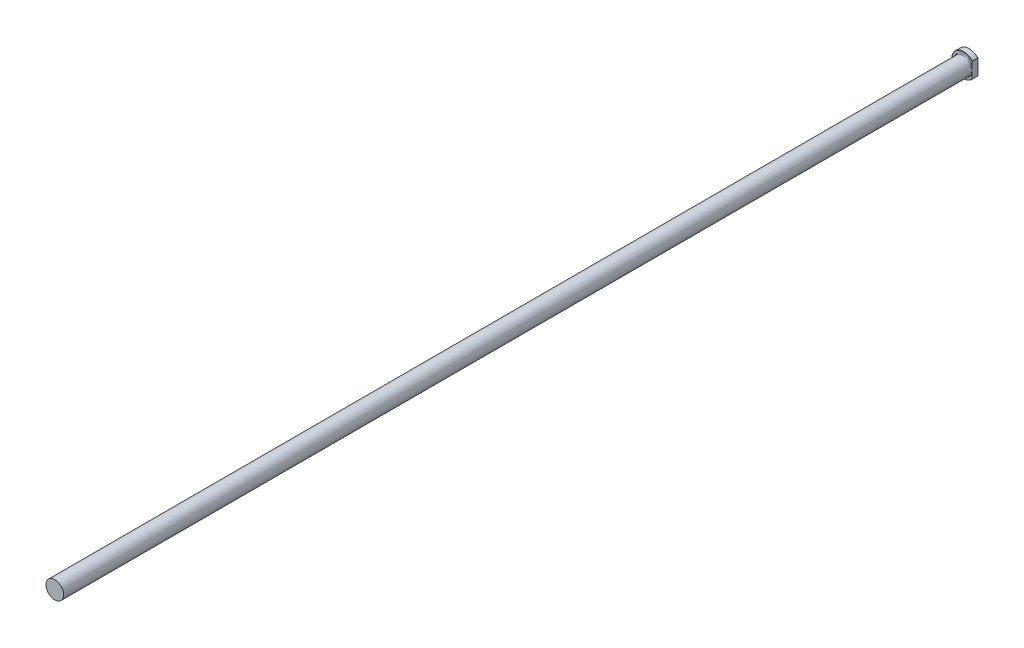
ISO-10303-21;
HEADER;
FILE_DESCRIPTION(('STEP AP214'),'2;1');
FILE_NAME('part.step','',(''),(''),'','','');
FILE_SCHEMA(('AUTOMOTIVE_DESIGN { 1 0 10303 214 1 1 1 1 }'));
ENDSEC;
DATA;
#1=APPLICATION_CONTEXT('core data for automotive mechanical design processes');
#2=APPLICATION_PROTOCOL_DEFINITION('international standard','automotive_design',2000,#1);
#3=PRODUCT_CONTEXT('',#1,'mechanical');
#4=PRODUCT('Part','Part','',(#3));
#5=PRODUCT_RELATED_PRODUCT_CATEGORY('part','',(#4));
#6=PRODUCT_DEFINITION_FORMATION('','',#4);
#7=PRODUCT_DEFINITION_CONTEXT('part definition',#1,'design');
#8=PRODUCT_DEFINITION('design','',#6,#7);
#9=PRODUCT_DEFINITION_SHAPE('','',#8);
#10=(LENGTH_UNIT() NAMED_UNIT(*) SI_UNIT(.MILLI.,.METRE.));
#11=(NAMED_UNIT(*) PLANE_ANGLE_UNIT() SI_UNIT($,.RADIAN.));
#12=(NAMED_UNIT(*) SI_UNIT($,.STERADIAN.) SOLID_ANGLE_UNIT());
#13=UNCERTAINTY_MEASURE_WITH_UNIT(LENGTH_MEASURE(1.E-05),#10,'distance_accuracy_value','');
#14=(GEOMETRIC_REPRESENTATION_CONTEXT(3) GLOBAL_UNCERTAINTY_ASSIGNED_CONTEXT((#13)) GLOBAL_UNIT_ASSIGNED_CONTEXT((#10,
#11,#12)) REPRESENTATION_CONTEXT('',''));
#15=CARTESIAN_POINT('',(0.,0.,0.));
#16=DIRECTION('',(0.,0.,1.));
#17=DIRECTION('',(1.,0.,0.));
#18=AXIS2_PLACEMENT_3D('',#15,#16,#17);
#19=CARTESIAN_POINT('',(0.,0.,0.));
#20=DIRECTION('',(0.,0.,1.));
#21=DIRECTION('',(1.,0.,0.));
#22=AXIS2_PLACEMENT_3D('',#19,#20,#21);
#23=PLANE('',#22);
#24=DIRECTION('',(0.,-1.,0.));
#25=VECTOR('',#24,1.);
#26=CARTESIAN_POINT('',(9.525,8.40026041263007,0.));
#27=LINE('',#26,#25);
#28=CARTESIAN_POINT('',(9.525,8.01107302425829,0.));
#29=VERTEX_POINT('',#28);
#30=CARTESIAN_POINT('',(9.525,-8.01107302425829,0.));
#31=VERTEX_POINT('',#30);
#32=EDGE_CURVE('E194',#29,#31,#27,.T.);
#33=ORIENTED_EDGE('',*,*,#32,.T.);
#34=CARTESIAN_POINT('',(0.,0.,0.));
#35=DIRECTION('',(0.,0.,1.));
#36=DIRECTION('',(1.,0.,0.));
#37=AXIS2_PLACEMENT_3D('',#34,#35,#36);
#38=CIRCLE('',#37,12.446);
#39=EDGE_CURVE('E11',#31,#29,#38,.F.);
#40=ORIENTED_EDGE('',*,*,#39,.T.);
#41=EDGE_LOOP('',(#33,#40));
#42=FACE_BOUND('',#41,.T.);
#43=ADVANCED_FACE('F34',(#42),#23,.F.);
#44=CARTESIAN_POINT('',(0.,0.,-2.14753999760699));
#45=DIRECTION('',(0.,0.,-1.));
#46=DIRECTION('',(-1.,0.,0.));
#47=AXIS2_PLACEMENT_3D('',#44,#45,#46);
#48=CYLINDRICAL_SURFACE('',#47,12.7);
#49=DIRECTION('',(0.,0.,-1.));
#50=VECTOR('',#49,1.);
#51=CARTESIAN_POINT('',(9.525,-8.40026041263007,7.62));
#52=LINE('',#51,#50);
#53=CARTESIAN_POINT('',(9.525,-8.40026041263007,6.096));
#54=VERTEX_POINT('',#53);
#55=CARTESIAN_POINT('',(9.525,-8.40026041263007,0.254000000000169));
#56=VERTEX_POINT('',#55);
#57=EDGE_CURVE('E192',#54,#56,#52,.T.);
#58=ORIENTED_EDGE('',*,*,#57,.F.);
#59=CARTESIAN_POINT('',(0.,0.,6.096));
#60=DIRECTION('',(0.,0.,-1.));
#61=DIRECTION('',(-1.,0.,0.));
#62=AXIS2_PLACEMENT_3D('',#59,#60,#61);
#63=CIRCLE('',#62,12.7);
#64=CARTESIAN_POINT('',(9.525,8.40026041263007,6.096));
#65=VERTEX_POINT('',#64);
#66=EDGE_CURVE('E111',#54,#65,#63,.T.);
#67=ORIENTED_EDGE('',*,*,#66,.T.);
#68=DIRECTION('',(0.,0.,-1.));
#69=VECTOR('',#68,1.);
#70=CARTESIAN_POINT('',(9.525,8.40026041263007,7.62));
#71=LINE('',#70,#69);
#72=CARTESIAN_POINT('',(9.525,8.40026041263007,0.254000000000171));
#73=VERTEX_POINT('',#72);
#74=EDGE_CURVE('E97',#65,#73,#71,.T.);
#75=ORIENTED_EDGE('',*,*,#74,.T.);
#76=CARTESIAN_POINT('',(0.,0.,0.254000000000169));
#77=DIRECTION('',(0.,0.,1.));
#78=DIRECTION('',(1.,0.,0.));
#79=AXIS2_PLACEMENT_3D('',#76,#77,#78);
#80=CIRCLE('',#79,12.7);
#81=EDGE_CURVE('E108',#73,#56,#80,.T.);
#82=ORIENTED_EDGE('',*,*,#81,.T.);
#83=EDGE_LOOP('',(#58,#67,#75,#82));
#84=FACE_BOUND('',#83,.T.);
#85=ADVANCED_FACE('F170',(#84),#48,.T.);
#86=CARTESIAN_POINT('',(0.,-10.287,6.35));
#87=DIRECTION('',(0.,0.,-1.));
#88=DIRECTION('',(-1.,0.,0.));
#89=AXIS2_PLACEMENT_3D('',#86,#87,#88);
#90=PLANE('',#89);
#91=DIRECTION('',(0.,-1.,0.));
#92=VECTOR('',#91,1.);
#93=CARTESIAN_POINT('',(9.525,-10.287,6.35));
#94=LINE('',#93,#92);
#95=CARTESIAN_POINT('',(9.525,8.01107302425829,6.35));
#96=VERTEX_POINT('',#95);
#97=CARTESIAN_POINT('',(9.525,3.8854528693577,6.35));
#98=VERTEX_POINT('',#97);
#99=EDGE_CURVE('E106',#96,#98,#94,.T.);
#100=ORIENTED_EDGE('',*,*,#99,.F.);
#101=CARTESIAN_POINT('',(0.,0.,6.35));
#102=DIRECTION('',(0.,0.,-1.));
#103=DIRECTION('',(-1.,0.,0.));
#104=AXIS2_PLACEMENT_3D('',#101,#102,#103);
#105=CIRCLE('',#104,12.446);
#106=CARTESIAN_POINT('',(9.525,-8.01107302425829,6.35));
#107=VERTEX_POINT('',#106);
#108=EDGE_CURVE('E43',#96,#107,#105,.F.);
#109=ORIENTED_EDGE('',*,*,#108,.T.);
#110=CARTESIAN_POINT('',(9.525,-3.88545286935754,6.35));
#111=VERTEX_POINT('',#110);
#112=EDGE_CURVE('E90',#111,#107,#94,.T.);
#113=ORIENTED_EDGE('',*,*,#112,.F.);
#114=CARTESIAN_POINT('',(0.,0.,6.35));
#115=DIRECTION('',(0.,0.,-1.));
#116=DIRECTION('',(-1.,0.,0.));
#117=AXIS2_PLACEMENT_3D('',#114,#115,#116);
#118=CIRCLE('',#117,10.287);
#119=EDGE_CURVE('E103',#111,#98,#118,.T.);
#120=ORIENTED_EDGE('',*,*,#119,.T.);
#121=EDGE_LOOP('',(#100,#109,#113,#120));
#122=FACE_BOUND('',#121,.T.);
#123=ADVANCED_FACE('F102',(#122),#90,.F.);
#124=CARTESIAN_POINT('',(0.,0.,7.112));
#125=DIRECTION('',(0.,0.,-1.));
#126=DIRECTION('',(-1.,0.,0.));
#127=AXIS2_PLACEMENT_3D('',#124,#125,#126);
#128=TOROIDAL_SURFACE('',#127,10.287,0.762000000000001);
#129=CARTESIAN_POINT('',(9.525,0.,7.112));
#130=CARTESIAN_POINT('',(9.525,-9.44099386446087E-11,7.11200098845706));
#131=CARTESIAN_POINT('',(9.525,3.32154531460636E-07,7.11200197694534));
#132=CARTESIAN_POINT('',(9.525,1.28451429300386E-06,7.11200383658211));
#133=CARTESIAN_POINT('',(9.525,1.92426583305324E-06,7.11200469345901));
#134=CARTESIAN_POINT('',(9.525,3.45251562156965E-06,7.11200645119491));
#135=CARTESIAN_POINT('',(9.525,4.36508578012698E-06,7.11200733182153));
#136=CARTESIAN_POINT('',(9.525,6.27569884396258E-06,7.11200893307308));
#137=CARTESIAN_POINT('',(9.525,7.27105454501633E-06,7.11200965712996));
#138=CARTESIAN_POINT('',(9.525,1.1053111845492E-05,7.11201227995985));
#139=CARTESIAN_POINT('',(9.525,1.39454465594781E-05,7.11201403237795));
#140=CARTESIAN_POINT('',(9.525,1.97324607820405E-05,7.11201697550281));
#141=CARTESIAN_POINT('',(9.525,2.26119122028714E-05,7.11201819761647));
#142=CARTESIAN_POINT('',(9.525,3.4584872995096E-05,7.11202320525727));
#143=CARTESIAN_POINT('',(9.525,4.37413909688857E-05,7.11202685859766));
#144=CARTESIAN_POINT('',(9.525,6.11943990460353E-05,7.11203235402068));
#145=CARTESIAN_POINT('',(9.525,6.9433967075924E-05,7.11203437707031));
#146=CARTESIAN_POINT('',(9.525,0.000130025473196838,7.1120489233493));
#147=CARTESIAN_POINT('',(9.525,0.00018269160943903,7.11205975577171));
#148=CARTESIAN_POINT('',(9.525,0.000390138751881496,7.11210716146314));
#149=CARTESIAN_POINT('',(9.525,0.000542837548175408,7.11215258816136));
#150=CARTESIAN_POINT('',(9.525,0.00114611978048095,7.11232885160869));
#151=CARTESIAN_POINT('',(9.525,0.00159790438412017,7.11245379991));
#152=CARTESIAN_POINT('',(9.525,0.00338883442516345,7.1129530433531));
#153=CARTESIAN_POINT('',(9.525,0.00472645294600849,7.11333464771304));
#154=CARTESIAN_POINT('',(9.525,0.010302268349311,7.1149209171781));
#155=CARTESIAN_POINT('',(9.525,0.0145423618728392,7.11611650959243));
#156=CARTESIAN_POINT('',(9.525,0.0867192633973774,7.13647430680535));
#157=CARTESIAN_POINT('',(9.525,0.154638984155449,7.15571958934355));
#158=CARTESIAN_POINT('',(9.525,0.28776793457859,7.19329752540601));
#159=CARTESIAN_POINT('',(9.525,0.352975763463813,7.21163562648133));
#160=CARTESIAN_POINT('',(9.525,0.491737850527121,7.25049193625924));
#161=CARTESIAN_POINT('',(9.525,0.565297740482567,7.27099045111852));
#162=CARTESIAN_POINT('',(9.525,0.713319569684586,7.31190355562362));
#163=CARTESIAN_POINT('',(9.525,0.787782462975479,7.33231469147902));
#164=CARTESIAN_POINT('',(9.525,0.915230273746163,7.36685900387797));
#165=CARTESIAN_POINT('',(9.525,0.968186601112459,7.38109752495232));
#166=CARTESIAN_POINT('',(9.525,1.0740305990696,7.40928089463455));
#167=CARTESIAN_POINT('',(9.525,1.12691809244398,7.42322640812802));
#168=CARTESIAN_POINT('',(9.525,1.28301939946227,7.4639169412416));
#169=CARTESIAN_POINT('',(9.525,1.3863423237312,7.49024387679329));
#170=CARTESIAN_POINT('',(9.525,1.68944304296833,7.56519607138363));
#171=CARTESIAN_POINT('',(9.525,1.88972054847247,7.6118333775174));
#172=CARTESIAN_POINT('',(9.525,2.29400914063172,7.69737651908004));
#173=CARTESIAN_POINT('',(9.525,2.49803760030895,7.73620305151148));
#174=CARTESIAN_POINT('',(9.525,2.81387823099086,7.78683388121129));
#175=CARTESIAN_POINT('',(9.525,2.92501123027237,7.80285941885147));
#176=CARTESIAN_POINT('',(9.525,3.14779936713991,7.83067921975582));
#177=CARTESIAN_POINT('',(9.525,3.25945441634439,7.84247417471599));
#178=CARTESIAN_POINT('',(9.525,3.48278494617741,7.86090616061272));
#179=CARTESIAN_POINT('',(9.525,3.59445882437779,7.86756210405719));
#180=CARTESIAN_POINT('',(9.525,3.81798645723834,7.87464978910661));
#181=CARTESIAN_POINT('',(9.525,3.92984010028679,7.87508450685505));
#182=CARTESIAN_POINT('',(9.525,4.10822628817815,7.86957869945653));
#183=CARTESIAN_POINT('',(9.525,4.17483681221,7.86613953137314));
#184=CARTESIAN_POINT('',(9.525,4.30786151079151,7.85605502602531));
#185=CARTESIAN_POINT('',(9.525,4.37427555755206,7.84940793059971));
#186=CARTESIAN_POINT('',(9.525,4.50574043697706,7.83247477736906));
#187=CARTESIAN_POINT('',(9.525,4.57079758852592,7.82223888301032));
#188=CARTESIAN_POINT('',(9.525,4.70005884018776,7.79743182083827));
#189=CARTESIAN_POINT('',(9.525,4.76426346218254,7.78286344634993));
#190=CARTESIAN_POINT('',(9.525,4.88990898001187,7.74883316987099));
#191=CARTESIAN_POINT('',(9.525,4.95137961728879,7.72948310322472));
#192=CARTESIAN_POINT('',(9.525,5.07224009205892,7.68446325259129));
#193=CARTESIAN_POINT('',(9.525,5.13162393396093,7.65877672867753));
#194=CARTESIAN_POINT('',(9.525,5.23453598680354,7.60548582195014));
#195=CARTESIAN_POINT('',(9.525,5.27881787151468,7.57935572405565));
#196=CARTESIAN_POINT('',(9.525,5.36306427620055,7.52087999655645));
#197=CARTESIAN_POINT('',(9.525,5.40304304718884,7.48855593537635));
#198=CARTESIAN_POINT('',(9.525,5.46004966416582,7.43195018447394));
#199=CARTESIAN_POINT('',(9.525,5.47955836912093,7.41018001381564));
#200=CARTESIAN_POINT('',(9.525,5.51527668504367,7.36405786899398));
#201=CARTESIAN_POINT('',(9.525,5.53148986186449,7.33970872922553));
#202=CARTESIAN_POINT('',(9.525,5.55708157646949,7.29290270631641));
#203=CARTESIAN_POINT('',(9.525,5.56715375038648,7.27082932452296));
#204=CARTESIAN_POINT('',(9.525,5.58350208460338,7.22531141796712));
#205=CARTESIAN_POINT('',(9.525,5.58978181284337,7.20186820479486));
#206=CARTESIAN_POINT('',(9.525,5.597992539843,7.15405846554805));
#207=CARTESIAN_POINT('',(9.525,5.59989521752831,7.12968695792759));
#208=CARTESIAN_POINT('',(9.525,5.59905756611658,7.08102434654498));
#209=CARTESIAN_POINT('',(9.525,5.59631730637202,7.05673324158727));
#210=CARTESIAN_POINT('',(9.525,5.5869855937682,7.01144696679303));
#211=CARTESIAN_POINT('',(9.525,5.58080461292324,6.99036439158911));
#212=CARTESIAN_POINT('',(9.525,5.56539036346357,6.94936001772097));
#213=CARTESIAN_POINT('',(9.525,5.55615604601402,6.9294386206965));
#214=CARTESIAN_POINT('',(9.525,5.52983987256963,6.88122286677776));
#215=CARTESIAN_POINT('',(9.525,5.51115325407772,6.85380627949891));
#216=CARTESIAN_POINT('',(9.525,5.46970194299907,6.80224417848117));
#217=CARTESIAN_POINT('',(9.525,5.44692558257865,6.77810838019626));
#218=CARTESIAN_POINT('',(9.525,5.38302390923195,6.71837292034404));
#219=CARTESIAN_POINT('',(9.525,5.33950371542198,6.6853569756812));
#220=CARTESIAN_POINT('',(9.525,5.24823311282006,6.6260538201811));
#221=CARTESIAN_POINT('',(9.525,5.20047793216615,6.59977433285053));
#222=CARTESIAN_POINT('',(9.525,5.10393883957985,6.5533412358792));
#223=CARTESIAN_POINT('',(9.525,5.05523269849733,6.5330229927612));
#224=CARTESIAN_POINT('',(9.525,4.95626543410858,6.49653819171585));
#225=CARTESIAN_POINT('',(9.525,4.90600280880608,6.48037579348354));
#226=CARTESIAN_POINT('',(9.525,4.80400444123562,6.4514042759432));
#227=CARTESIAN_POINT('',(9.525,4.75225910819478,6.43862943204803));
#228=CARTESIAN_POINT('',(9.525,4.64815423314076,6.4161187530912));
#229=CARTESIAN_POINT('',(9.525,4.59579505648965,6.4063811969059));
#230=CARTESIAN_POINT('',(9.525,4.4692230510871,6.38607697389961));
#231=CARTESIAN_POINT('',(9.525,4.39480530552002,6.37679143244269));
#232=CARTESIAN_POINT('',(9.525,4.24554902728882,6.36251533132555));
#233=CARTESIAN_POINT('',(9.525,4.17071032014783,6.35752670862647));
#234=CARTESIAN_POINT('',(9.525,3.94554241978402,6.34796961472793));
#235=CARTESIAN_POINT('',(9.525,3.7949773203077,6.34886803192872));
#236=CARTESIAN_POINT('',(9.525,3.50146085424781,6.36115019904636));
#237=CARTESIAN_POINT('',(9.525,3.35848345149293,6.37204043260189));
#238=CARTESIAN_POINT('',(9.525,3.07426378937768,6.40134428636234));
#239=CARTESIAN_POINT('',(9.525,2.93301629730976,6.41970825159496));
#240=CARTESIAN_POINT('',(9.525,2.69200870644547,6.45620557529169));
#241=CARTESIAN_POINT('',(9.525,2.59202022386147,6.47288103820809));
#242=CARTESIAN_POINT('',(9.525,2.39256281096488,6.50875277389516));
#243=CARTESIAN_POINT('',(9.525,2.2930935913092,6.52794744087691));
#244=CARTESIAN_POINT('',(9.525,2.09221482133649,6.56894158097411));
#245=CARTESIAN_POINT('',(9.525,1.99081583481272,6.59079241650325));
#246=CARTESIAN_POINT('',(9.525,1.7881659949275,6.63639281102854));
#247=CARTESIAN_POINT('',(9.525,1.68691624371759,6.66014724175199));
#248=CARTESIAN_POINT('',(9.525,1.44674283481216,6.71837735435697));
#249=CARTESIAN_POINT('',(9.525,1.3079822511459,6.75352328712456));
#250=CARTESIAN_POINT('',(9.525,1.03253770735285,6.82543172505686));
#251=CARTESIAN_POINT('',(9.525,0.895847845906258,6.86217183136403));
#252=CARTESIAN_POINT('',(9.525,0.698942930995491,6.91606570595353));
#253=CARTESIAN_POINT('',(9.525,0.63858914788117,6.93271644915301));
#254=CARTESIAN_POINT('',(9.525,0.51767457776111,6.96627853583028));
#255=CARTESIAN_POINT('',(9.525,0.457114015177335,6.98319069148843));
#256=CARTESIAN_POINT('',(9.525,0.333074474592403,7.01795936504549));
#257=CARTESIAN_POINT('',(9.525,0.269597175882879,7.0358217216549));
#258=CARTESIAN_POINT('',(9.525,0.143679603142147,7.07137859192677));
#259=CARTESIAN_POINT('',(9.525,0.0812388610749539,7.08907126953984));
#260=CARTESIAN_POINT('',(9.525,0.0145389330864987,7.10788447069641));
#261=CARTESIAN_POINT('',(9.525,0.0102954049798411,7.10908101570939));
#262=CARTESIAN_POINT('',(9.525,0.00471880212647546,7.11066751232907));
#263=CARTESIAN_POINT('',(9.525,0.00338382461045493,7.11104836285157));
#264=CARTESIAN_POINT('',(9.525,0.00159619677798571,7.11154668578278));
#265=CARTESIAN_POINT('',(9.525,0.0011450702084,7.1116714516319));
#266=CARTESIAN_POINT('',(9.525,0.000542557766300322,7.11184749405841));
#267=CARTESIAN_POINT('',(9.525,0.000389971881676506,7.11189288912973));
#268=CARTESIAN_POINT('',(9.525,0.000182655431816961,7.11194026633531));
#269=CARTESIAN_POINT('',(9.525,0.000130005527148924,7.11195109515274));
#270=CARTESIAN_POINT('',(9.525,6.94304956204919E-05,7.11196563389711));
#271=CARTESIAN_POINT('',(9.525,6.11918657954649E-05,7.11196765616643));
#272=CARTESIAN_POINT('',(9.525,4.37407480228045E-05,7.11197314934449));
#273=CARTESIAN_POINT('',(9.525,3.45851327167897E-05,7.11197680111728));
#274=CARTESIAN_POINT('',(9.525,2.2613096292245E-05,7.11198180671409));
#275=CARTESIAN_POINT('',(9.525,1.97337150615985E-05,7.11198302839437));
#276=CARTESIAN_POINT('',(9.525,1.3946766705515E-05,7.1119859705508));
#277=CARTESIAN_POINT('',(9.525,1.10544195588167E-05,7.11198772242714));
#278=CARTESIAN_POINT('',(9.525,7.27225789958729E-06,7.11199034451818));
#279=CARTESIAN_POINT('',(9.525,6.27685165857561E-06,7.11199106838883));
#280=CARTESIAN_POINT('',(9.525,4.36610391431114E-06,7.11199266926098));
#281=CARTESIAN_POINT('',(9.525,3.45344862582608E-06,7.11199354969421));
#282=CARTESIAN_POINT('',(9.525,1.92499723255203E-06,7.11199530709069));
#283=CARTESIAN_POINT('',(9.525,1.28513615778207E-06,7.11199616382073));
#284=CARTESIAN_POINT('',(9.525,3.32502504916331E-07,7.11199802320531));
#285=CARTESIAN_POINT('',(9.525,9.44057260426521E-11,7.11199901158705));
#286=CARTESIAN_POINT('',(9.525,0.,7.112));
#287=B_SPLINE_CURVE_WITH_KNOTS('',3,(#129,#130,#131,#132,#133,#134,#135,#136,#137,#138,#139,
#140,#141,#142,#143,#144,#145,#146,#147,#148,#149,#150,#151,#152,#153,#154,#155,#156,#157,#158,
#159,#160,#161,#162,#163,#164,#165,#166,#167,#168,#169,#170,#171,#172,#173,#174,#175,#176,#177,
#178,#179,#180,#181,#182,#183,#184,#185,#186,#187,#188,#189,#190,#191,#192,#193,#194,#195,#196,
#197,#198,#199,#200,#201,#202,#203,#204,#205,#206,#207,#208,#209,#210,#211,#212,#213,#214,#215,
#216,#217,#218,#219,#220,#221,#222,#223,#224,#225,#226,#227,#228,#229,#230,#231,#232,#233,#234,
#235,#236,#237,#238,#239,#240,#241,#242,#243,#244,#245,#246,#247,#248,#249,#250,#251,#252,#253,
#254,#255,#256,#257,#258,#259,#260,#261,#262,#263,#264,#265,#266,#267,#268,#269,#270,#271,#272,
#273,#274,#275,#276,#277,#278,#279,#280,#281,#282,#283,#284,#285,#286),.UNSPECIFIED.,.T.,.F.,(4,
2,2,2,2,2,2,2,2,2,2,2,2,2,2,2,2,2,2,2,2,2,2,2,2,2,2,2,2,2,2,2,2,2,2,2,2,2,2,2,2,2,2,2,2,2,2,2,2,
2,2,2,2,2,2,2,2,2,2,2,2,2,2,2,2,2,2,2,2,2,2,2,2,2,2,2,2,2,4),(0.,2.98024360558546E-06,
6.18300403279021E-06,9.9669179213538E-06,1.36568109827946E-05,2.37621937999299E-05,
3.31384128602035E-05,6.26536468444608E-05,8.80741046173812E-05,0.00024940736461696,
0.000726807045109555,0.00213358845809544,0.00630588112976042,0.0195229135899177,
0.231296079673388,0.434509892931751,0.663596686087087,0.895224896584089,1.0597356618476,
1.2238205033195,1.5436875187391,2.16049297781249,2.78327570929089,3.12006022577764,
3.45678965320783,3.79227386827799,4.12759758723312,4.32763355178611,4.52777927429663,
4.72523214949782,4.92255799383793,5.11564525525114,5.30924819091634,5.46313690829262,
5.61649918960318,5.70396990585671,5.79134546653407,5.86384674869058,5.93627971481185,
6.00918004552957,6.08207928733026,6.14772258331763,6.21338845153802,6.31235848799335,
6.41161550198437,6.57457319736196,6.7377169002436,6.89580366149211,7.05404804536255,
7.21383723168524,7.37353570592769,7.59835636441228,7.82327831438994,8.27437601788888,
8.70432670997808,9.13146629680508,9.43554306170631,9.73942693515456,10.0505865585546,
10.3625696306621,10.7919732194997,11.2165881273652,11.4044136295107,11.5930459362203,
11.790875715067,11.9855654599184,11.9987931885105,12.0029572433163,12.0043619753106,
12.0048390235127,12.0050003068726,12.0050257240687,12.0050552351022,12.0050646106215,
12.005074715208,12.0050784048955,12.005082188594,12.0050853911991,12.0050883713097),.UNSPECIFIED.);
#288=CARTESIAN_POINT('',(9.525,0.,7.112));
#289=VERTEX_POINT('',#288);
#290=EDGE_CURVE('E93',#98,#289,#287,.T.);
#291=ORIENTED_EDGE('',*,*,#290,.F.);
#292=ORIENTED_EDGE('',*,*,#119,.F.);
#293=CARTESIAN_POINT('',(9.525,0.,7.112));
#294=CARTESIAN_POINT('',(9.525,9.44099960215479E-11,7.11199901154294));
#295=CARTESIAN_POINT('',(9.525,-3.32154531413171E-07,7.11199802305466));
#296=CARTESIAN_POINT('',(9.525,-1.28451429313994E-06,7.11199616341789));
#297=CARTESIAN_POINT('',(9.525,-1.92426583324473E-06,7.11199530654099));
#298=CARTESIAN_POINT('',(9.525,-3.45251562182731E-06,7.11199354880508));
#299=CARTESIAN_POINT('',(9.525,-4.36508578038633E-06,7.11199266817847));
#300=CARTESIAN_POINT('',(9.525,-6.27569884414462E-06,7.11199106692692));
#301=CARTESIAN_POINT('',(9.525,-7.27105454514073E-06,7.11199034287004));
#302=CARTESIAN_POINT('',(9.525,-1.10531118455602E-05,7.11198772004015));
#303=CARTESIAN_POINT('',(9.525,-1.39454465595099E-05,7.11198596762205));
#304=CARTESIAN_POINT('',(9.525,-1.97324607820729E-05,7.11198302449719));
#305=CARTESIAN_POINT('',(9.525,-2.26119122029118E-05,7.11198180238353));
#306=CARTESIAN_POINT('',(9.525,-3.45848729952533E-05,7.11197679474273));
#307=CARTESIAN_POINT('',(9.525,-4.3741390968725E-05,7.11197314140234));
#308=CARTESIAN_POINT('',(9.525,-6.11943990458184E-05,7.11196764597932));
#309=CARTESIAN_POINT('',(9.525,-6.94339670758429E-05,7.11196562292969));
#310=CARTESIAN_POINT('',(9.525,-0.000130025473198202,7.1119510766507));
#311=CARTESIAN_POINT('',(9.525,-0.000182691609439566,7.11194024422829));
#312=CARTESIAN_POINT('',(9.525,-0.000390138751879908,7.11189283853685));
#313=CARTESIAN_POINT('',(9.525,-0.000542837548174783,7.11184741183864));
#314=CARTESIAN_POINT('',(9.525,-0.00114611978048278,7.11167114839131));
#315=CARTESIAN_POINT('',(9.525,-0.00159790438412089,7.11154620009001));
#316=CARTESIAN_POINT('',(9.525,-0.0033888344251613,7.11104695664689));
#317=CARTESIAN_POINT('',(9.525,-0.00472645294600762,7.11066535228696));
#318=CARTESIAN_POINT('',(9.525,-0.0103022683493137,7.10907908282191));
#319=CARTESIAN_POINT('',(9.525,-0.0145423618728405,7.10788349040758));
#320=CARTESIAN_POINT('',(9.525,-0.0867192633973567,7.08752569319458));
#321=CARTESIAN_POINT('',(9.525,-0.154638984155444,7.06828041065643));
#322=CARTESIAN_POINT('',(9.525,-0.287767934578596,7.030702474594));
#323=CARTESIAN_POINT('',(9.525,-0.352975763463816,7.01236437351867));
#324=CARTESIAN_POINT('',(9.525,-0.49173785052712,6.97350806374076));
#325=CARTESIAN_POINT('',(9.525,-0.565297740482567,6.95300954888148));
#326=CARTESIAN_POINT('',(9.525,-0.713319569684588,6.91209644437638));
#327=CARTESIAN_POINT('',(9.525,-0.78778246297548,6.89168530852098));
#328=CARTESIAN_POINT('',(9.525,-0.915230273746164,6.85714099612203));
#329=CARTESIAN_POINT('',(9.525,-0.968186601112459,6.84290247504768));
#330=CARTESIAN_POINT('',(9.525,-1.0740305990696,6.81471910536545));
#331=CARTESIAN_POINT('',(9.525,-1.12691809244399,6.80077359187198));
#332=CARTESIAN_POINT('',(9.525,-1.28301939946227,6.7600830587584));
#333=CARTESIAN_POINT('',(9.525,-1.3863423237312,6.73375612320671));
#334=CARTESIAN_POINT('',(9.525,-1.68944304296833,6.65880392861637));
#335=CARTESIAN_POINT('',(9.525,-1.88972054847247,6.61216662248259));
#336=CARTESIAN_POINT('',(9.525,-2.29400914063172,6.52662348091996));
#337=CARTESIAN_POINT('',(9.525,-2.49803760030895,6.48779694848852));
#338=CARTESIAN_POINT('',(9.525,-2.81387823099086,6.43716611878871));
#339=CARTESIAN_POINT('',(9.525,-2.92501123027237,6.42114058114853));
#340=CARTESIAN_POINT('',(9.525,-3.14779936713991,6.39332078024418));
#341=CARTESIAN_POINT('',(9.525,-3.25945441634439,6.38152582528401));
#342=CARTESIAN_POINT('',(9.525,-3.48278494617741,6.36309383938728));
#343=CARTESIAN_POINT('',(9.525,-3.59445882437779,6.35643789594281));
#344=CARTESIAN_POINT('',(9.525,-3.81798645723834,6.34935021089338));
#345=CARTESIAN_POINT('',(9.525,-3.92984010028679,6.34891549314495));
#346=CARTESIAN_POINT('',(9.525,-4.10822628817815,6.35442130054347));
#347=CARTESIAN_POINT('',(9.525,-4.17483681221,6.35786046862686));
#348=CARTESIAN_POINT('',(9.525,-4.30786151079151,6.36794497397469));
#349=CARTESIAN_POINT('',(9.525,-4.37427555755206,6.37459206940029));
#350=CARTESIAN_POINT('',(9.525,-4.50574043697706,6.39152522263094));
#351=CARTESIAN_POINT('',(9.525,-4.57079758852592,6.40176111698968));
#352=CARTESIAN_POINT('',(9.525,-4.70005884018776,6.42656817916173));
#353=CARTESIAN_POINT('',(9.525,-4.76426346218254,6.44113655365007));
#354=CARTESIAN_POINT('',(9.525,-4.88990898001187,6.475166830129));
#355=CARTESIAN_POINT('',(9.525,-4.95137961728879,6.49451689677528));
#356=CARTESIAN_POINT('',(9.525,-5.07224009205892,6.53953674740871));
#357=CARTESIAN_POINT('',(9.525,-5.13162393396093,6.56522327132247));
#358=CARTESIAN_POINT('',(9.525,-5.23453598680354,6.61851417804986));
#359=CARTESIAN_POINT('',(9.525,-5.27881787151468,6.64464427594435));
#360=CARTESIAN_POINT('',(9.525,-5.36306427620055,6.70312000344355));
#361=CARTESIAN_POINT('',(9.525,-5.40304304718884,6.73544406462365));
#362=CARTESIAN_POINT('',(9.525,-5.46004966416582,6.79204981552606));
#363=CARTESIAN_POINT('',(9.525,-5.47955836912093,6.81381998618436));
#364=CARTESIAN_POINT('',(9.525,-5.51527668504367,6.85994213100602));
#365=CARTESIAN_POINT('',(9.525,-5.53148986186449,6.88429127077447));
#366=CARTESIAN_POINT('',(9.525,-5.55708157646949,6.93109729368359));
#367=CARTESIAN_POINT('',(9.525,-5.56715375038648,6.95317067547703));
#368=CARTESIAN_POINT('',(9.525,-5.58350208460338,6.99868858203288));
#369=CARTESIAN_POINT('',(9.525,-5.58978181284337,7.02213179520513));
#370=CARTESIAN_POINT('',(9.525,-5.597992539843,7.06994153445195));
#371=CARTESIAN_POINT('',(9.525,-5.59989521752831,7.0943130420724));
#372=CARTESIAN_POINT('',(9.525,-5.59905756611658,7.14297565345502));
#373=CARTESIAN_POINT('',(9.525,-5.59631730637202,7.16726675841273));
#374=CARTESIAN_POINT('',(9.525,-5.5869855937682,7.21255303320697));
#375=CARTESIAN_POINT('',(9.525,-5.58080461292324,7.23363560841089));
#376=CARTESIAN_POINT('',(9.525,-5.56539036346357,7.27463998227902));
#377=CARTESIAN_POINT('',(9.525,-5.55615604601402,7.2945613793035));
#378=CARTESIAN_POINT('',(9.525,-5.52983987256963,7.34277713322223));
#379=CARTESIAN_POINT('',(9.525,-5.51115325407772,7.37019372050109));
#380=CARTESIAN_POINT('',(9.525,-5.46970194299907,7.42175582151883));
#381=CARTESIAN_POINT('',(9.525,-5.44692558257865,7.44589161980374));
#382=CARTESIAN_POINT('',(9.525,-5.38302390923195,7.50562707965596));
#383=CARTESIAN_POINT('',(9.525,-5.33950371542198,7.5386430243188));
#384=CARTESIAN_POINT('',(9.525,-5.24823311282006,7.5979461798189));
#385=CARTESIAN_POINT('',(9.525,-5.20047793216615,7.62422566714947));
#386=CARTESIAN_POINT('',(9.525,-5.10393883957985,7.6706587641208));
#387=CARTESIAN_POINT('',(9.525,-5.05523269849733,7.6909770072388));
#388=CARTESIAN_POINT('',(9.525,-4.95626543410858,7.72746180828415));
#389=CARTESIAN_POINT('',(9.525,-4.90600280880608,7.74362420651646));
#390=CARTESIAN_POINT('',(9.525,-4.80400444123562,7.7725957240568));
#391=CARTESIAN_POINT('',(9.525,-4.75225910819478,7.78537056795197));
#392=CARTESIAN_POINT('',(9.525,-4.64815423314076,7.8078812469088));
#393=CARTESIAN_POINT('',(9.525,-4.59579505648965,7.8176188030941));
#394=CARTESIAN_POINT('',(9.525,-4.4692230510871,7.83792302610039));
#395=CARTESIAN_POINT('',(9.525,-4.39480530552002,7.84720856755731));
#396=CARTESIAN_POINT('',(9.525,-4.24554902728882,7.86148466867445));
#397=CARTESIAN_POINT('',(9.525,-4.17071032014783,7.86647329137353));
#398=CARTESIAN_POINT('',(9.525,-3.94554241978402,7.87603038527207));
#399=CARTESIAN_POINT('',(9.525,-3.7949773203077,7.87513196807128));
#400=CARTESIAN_POINT('',(9.525,-3.50146085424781,7.86284980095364));
#401=CARTESIAN_POINT('',(9.525,-3.35848345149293,7.85195956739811));
#402=CARTESIAN_POINT('',(9.525,-3.07426378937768,7.82265571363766));
#403=CARTESIAN_POINT('',(9.525,-2.93301629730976,7.80429174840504));
#404=CARTESIAN_POINT('',(9.525,-2.69200870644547,7.76779442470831));
#405=CARTESIAN_POINT('',(9.525,-2.59202022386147,7.75111896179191));
#406=CARTESIAN_POINT('',(9.525,-2.39256281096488,7.71524722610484));
#407=CARTESIAN_POINT('',(9.525,-2.2930935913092,7.69605255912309));
#408=CARTESIAN_POINT('',(9.525,-2.09221482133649,7.65505841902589));
#409=CARTESIAN_POINT('',(9.525,-1.99081583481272,7.63320758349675));
#410=CARTESIAN_POINT('',(9.525,-1.7881659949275,7.58760718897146));
#411=CARTESIAN_POINT('',(9.525,-1.68691624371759,7.56385275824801));
#412=CARTESIAN_POINT('',(9.525,-1.44674283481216,7.50562264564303));
#413=CARTESIAN_POINT('',(9.525,-1.3079822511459,7.47047671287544));
#414=CARTESIAN_POINT('',(9.525,-1.03253770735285,7.39856827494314));
#415=CARTESIAN_POINT('',(9.525,-0.895847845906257,7.36182816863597));
#416=CARTESIAN_POINT('',(9.525,-0.698942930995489,7.30793429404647));
#417=CARTESIAN_POINT('',(9.525,-0.638589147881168,7.29128355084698));
#418=CARTESIAN_POINT('',(9.525,-0.517674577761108,7.25772146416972));
#419=CARTESIAN_POINT('',(9.525,-0.457114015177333,7.24080930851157));
#420=CARTESIAN_POINT('',(9.525,-0.333074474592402,7.20604063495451));
#421=CARTESIAN_POINT('',(9.525,-0.269597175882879,7.1881782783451));
#422=CARTESIAN_POINT('',(9.525,-0.143679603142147,7.15262140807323));
#423=CARTESIAN_POINT('',(9.525,-0.0812388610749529,7.13492873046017));
#424=CARTESIAN_POINT('',(9.525,-0.0145389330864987,7.11611552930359));
#425=CARTESIAN_POINT('',(9.525,-0.0102954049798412,7.11491898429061));
#426=CARTESIAN_POINT('',(9.525,-0.00471880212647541,7.11333248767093));
#427=CARTESIAN_POINT('',(9.525,-0.00338382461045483,7.11295163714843));
#428=CARTESIAN_POINT('',(9.525,-0.00159619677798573,7.11245331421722));
#429=CARTESIAN_POINT('',(9.525,-0.00114507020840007,7.1123285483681));
#430=CARTESIAN_POINT('',(9.525,-0.000542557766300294,7.11215250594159));
#431=CARTESIAN_POINT('',(9.525,-0.000389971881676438,7.11210711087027));
#432=CARTESIAN_POINT('',(9.525,-0.000182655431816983,7.11205973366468));
#433=CARTESIAN_POINT('',(9.525,-0.000130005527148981,7.11204890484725));
#434=CARTESIAN_POINT('',(9.525,-6.94304956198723E-05,7.11203436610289));
#435=CARTESIAN_POINT('',(9.525,-6.11918657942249E-05,7.11203234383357));
#436=CARTESIAN_POINT('',(9.525,-4.37407480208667E-05,7.11202685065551));
#437=CARTESIAN_POINT('',(9.525,-3.45851327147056E-05,7.11202319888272));
#438=CARTESIAN_POINT('',(9.525,-2.26130962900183E-05,7.11201819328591));
#439=CARTESIAN_POINT('',(9.525,-1.97337150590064E-05,7.11201697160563));
#440=CARTESIAN_POINT('',(9.525,-1.39467667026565E-05,7.1120140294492));
#441=CARTESIAN_POINT('',(9.525,-1.10544195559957E-05,7.11201227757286));
#442=CARTESIAN_POINT('',(9.525,-7.27225789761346E-06,7.11200965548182));
#443=CARTESIAN_POINT('',(9.525,-6.27685165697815E-06,7.11200893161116));
#444=CARTESIAN_POINT('',(9.525,-4.36610391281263E-06,7.11200733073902));
#445=CARTESIAN_POINT('',(9.525,-3.45344862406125E-06,7.11200645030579));
#446=CARTESIAN_POINT('',(9.525,-1.9249972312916E-06,7.11200469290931));
#447=CARTESIAN_POINT('',(9.525,-1.28513615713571E-06,7.11200383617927));
#448=CARTESIAN_POINT('',(9.525,-3.32502504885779E-07,7.11200197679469));
#449=CARTESIAN_POINT('',(9.525,-9.44057833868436E-11,7.11200098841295));
#450=CARTESIAN_POINT('',(9.525,0.,7.112));
#451=B_SPLINE_CURVE_WITH_KNOTS('',3,(#293,#294,#295,#296,#297,#298,#299,#300,#301,#302,#303,
#304,#305,#306,#307,#308,#309,#310,#311,#312,#313,#314,#315,#316,#317,#318,#319,#320,#321,#322,
#323,#324,#325,#326,#327,#328,#329,#330,#331,#332,#333,#334,#335,#336,#337,#338,#339,#340,#341,
#342,#343,#344,#345,#346,#347,#348,#349,#350,#351,#352,#353,#354,#355,#356,#357,#358,#359,#360,
#361,#362,#363,#364,#365,#366,#367,#368,#369,#370,#371,#372,#373,#374,#375,#376,#377,#378,#379,
#380,#381,#382,#383,#384,#385,#386,#387,#388,#389,#390,#391,#392,#393,#394,#395,#396,#397,#398,
#399,#400,#401,#402,#403,#404,#405,#406,#407,#408,#409,#410,#411,#412,#413,#414,#415,#416,#417,
#418,#419,#420,#421,#422,#423,#424,#425,#426,#427,#428,#429,#430,#431,#432,#433,#434,#435,#436,
#437,#438,#439,#440,#441,#442,#443,#444,#445,#446,#447,#448,#449,#450),.UNSPECIFIED.,.T.,.F.,(4,
2,2,2,2,2,2,2,2,2,2,2,2,2,2,2,2,2,2,2,2,2,2,2,2,2,2,2,2,2,2,2,2,2,2,2,2,2,2,2,2,2,2,2,2,2,2,2,2,
2,2,2,2,2,2,2,2,2,2,2,2,2,2,2,2,2,2,2,2,2,2,2,2,2,2,2,2,2,4),(0.,2.98024360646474E-06,
6.18300403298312E-06,9.96691792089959E-06,1.36568109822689E-05,2.37621937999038E-05,
3.31384128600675E-05,6.26536468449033E-05,8.80741046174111E-05,0.00024940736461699,
0.000726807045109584,0.00213358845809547,0.00630588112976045,0.0195229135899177,
0.231296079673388,0.434509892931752,0.663596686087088,0.89522489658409,1.0597356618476,
1.2238205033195,1.5436875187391,2.16049297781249,2.78327570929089,3.12006022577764,
3.45678965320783,3.79227386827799,4.12759758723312,4.32763355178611,4.52777927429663,
4.72523214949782,4.92255799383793,5.11564525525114,5.30924819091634,5.46313690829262,
5.61649918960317,5.70396990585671,5.79134546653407,5.86384674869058,5.93627971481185,
6.00918004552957,6.08207928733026,6.14772258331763,6.21338845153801,6.31235848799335,
6.41161550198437,6.57457319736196,6.7377169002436,6.89580366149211,7.05404804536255,
7.21383723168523,7.37353570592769,7.59835636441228,7.82327831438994,8.27437601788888,
8.70432670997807,9.13146629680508,9.43554306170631,9.73942693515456,10.0505865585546,
10.3625696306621,10.7919732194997,11.2165881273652,11.4044136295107,11.5930459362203,
11.790875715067,11.9855654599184,11.9987931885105,12.0029572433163,12.0043619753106,
12.0048390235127,12.0050003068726,12.0050257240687,12.0050552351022,12.0050646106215,
12.005074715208,12.0050784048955,12.005082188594,12.0050853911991,12.0050883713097),.UNSPECIFIED.);
#452=EDGE_CURVE('E86',#289,#111,#451,.T.);
#453=ORIENTED_EDGE('',*,*,#452,.F.);
#454=CARTESIAN_POINT('',(0.,0.,7.112));
#455=DIRECTION('',(0.,0.,-1.));
#456=DIRECTION('',(-1.,0.,0.));
#457=AXIS2_PLACEMENT_3D('',#454,#455,#456);
#458=CIRCLE('',#457,9.525);
#459=EDGE_CURVE('E109',#289,#289,#458,.T.);
#460=ORIENTED_EDGE('',*,*,#459,.T.);
#461=EDGE_LOOP('',(#291,#292,#453,#460));
#462=FACE_BOUND('',#461,.T.);
#463=ADVANCED_FACE('F107',(#462),#128,.F.);
#464=CARTESIAN_POINT('',(0.,0.,-2.14753999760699));
#465=DIRECTION('',(0.,0.,-1.));
#466=DIRECTION('',(-1.,0.,0.));
#467=AXIS2_PLACEMENT_3D('',#464,#465,#466);
#468=CYLINDRICAL_SURFACE('',#467,9.525);
#469=ORIENTED_EDGE('',*,*,#459,.F.);
#470=EDGE_LOOP('',(#469));
#471=FACE_BOUND('',#470,.T.);
#472=CARTESIAN_POINT('',(0.,0.,990.6));
#473=DIRECTION('',(0.,0.,-1.));
#474=DIRECTION('',(-1.,0.,0.));
#475=AXIS2_PLACEMENT_3D('',#472,#473,#474);
#476=CIRCLE('',#475,9.525);
#477=CARTESIAN_POINT('',(-9.525,0.,990.6));
#478=VERTEX_POINT('',#477);
#479=EDGE_CURVE('E113',#478,#478,#476,.T.);
#480=ORIENTED_EDGE('',*,*,#479,.T.);
#481=EDGE_LOOP('',(#480));
#482=FACE_BOUND('',#481,.T.);
#483=ADVANCED_FACE('F178',(#471,#482),#468,.T.);
#484=CARTESIAN_POINT('',(0.,0.,990.6));
#485=DIRECTION('',(0.,0.,-1.));
#486=DIRECTION('',(-1.,0.,0.));
#487=AXIS2_PLACEMENT_3D('',#484,#485,#486);
#488=PLANE('',#487);
#489=ORIENTED_EDGE('',*,*,#479,.F.);
#490=EDGE_LOOP('',(#489));
#491=FACE_BOUND('',#490,.T.);
#492=ADVANCED_FACE('F134',(#491),#488,.F.);
#493=CARTESIAN_POINT('',(9.525,8.40026041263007,7.62));
#494=DIRECTION('',(1.,0.,0.));
#495=DIRECTION('',(0.,0.,-1.));
#496=AXIS2_PLACEMENT_3D('',#493,#494,#495);
#497=PLANE('',#496);
#498=ORIENTED_EDGE('',*,*,#74,.F.);
#499=CARTESIAN_POINT('',(9.525,8.40026041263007,6.096));
#500=CARTESIAN_POINT('',(9.525,8.33565962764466,6.13873749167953));
#501=CARTESIAN_POINT('',(9.525,8.27092695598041,6.18127290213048));
#502=CARTESIAN_POINT('',(9.525,8.14119782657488,6.2659395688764));
#503=CARTESIAN_POINT('',(9.525,8.07620136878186,6.30807082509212));
#504=CARTESIAN_POINT('',(9.525,8.01107302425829,6.35));
#505=B_SPLINE_CURVE_WITH_KNOTS('',3,(#499,#500,#501,#502,#503,#504),.UNSPECIFIED.,.F.,.F.,(4,2,
4),(0.,0.23237086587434,0.464741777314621),.UNSPECIFIED.);
#506=EDGE_CURVE('E158',#65,#96,#505,.T.);
#507=ORIENTED_EDGE('',*,*,#506,.T.);
#508=ORIENTED_EDGE('',*,*,#99,.T.);
#509=ORIENTED_EDGE('',*,*,#290,.T.);
#510=ORIENTED_EDGE('',*,*,#452,.T.);
#511=ORIENTED_EDGE('',*,*,#112,.T.);
#512=CARTESIAN_POINT('',(9.525,-8.01107302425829,6.35));
#513=CARTESIAN_POINT('',(9.525,-8.07620136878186,6.30807082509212));
#514=CARTESIAN_POINT('',(9.525,-8.14119782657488,6.2659395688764));
#515=CARTESIAN_POINT('',(9.525,-8.27092695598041,6.18127290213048));
#516=CARTESIAN_POINT('',(9.525,-8.33565962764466,6.13873749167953));
#517=CARTESIAN_POINT('',(9.525,-8.40026041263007,6.096));
#518=B_SPLINE_CURVE_WITH_KNOTS('',3,(#512,#513,#514,#515,#516,#517),.UNSPECIFIED.,.F.,.F.,(4,2,
4),(0.,0.232370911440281,0.46474177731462),.UNSPECIFIED.);
#519=EDGE_CURVE('E153',#107,#54,#518,.T.);
#520=ORIENTED_EDGE('',*,*,#519,.T.);
#521=ORIENTED_EDGE('',*,*,#57,.T.);
#522=CARTESIAN_POINT('',(9.525,-8.40026041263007,0.254000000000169));
#523=CARTESIAN_POINT('',(9.525,-8.33565962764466,0.211262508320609));
#524=CARTESIAN_POINT('',(9.525,-8.27092695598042,0.168727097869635));
#525=CARTESIAN_POINT('',(9.525,-8.14119782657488,0.0840604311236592));
#526=CARTESIAN_POINT('',(9.525,-8.07620136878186,0.0419291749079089));
#527=CARTESIAN_POINT('',(9.525,-8.01107302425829,0.));
#528=B_SPLINE_CURVE_WITH_KNOTS('',3,(#522,#523,#524,#525,#526,#527),.UNSPECIFIED.,.F.,.F.,(4,2,
4),(0.,0.232370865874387,0.464741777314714),.UNSPECIFIED.);
#529=EDGE_CURVE('E50',#56,#31,#528,.T.);
#530=ORIENTED_EDGE('',*,*,#529,.T.);
#531=ORIENTED_EDGE('',*,*,#32,.F.);
#532=CARTESIAN_POINT('',(9.525,8.01107302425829,0.));
#533=CARTESIAN_POINT('',(9.525,8.07620136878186,0.0419291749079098));
#534=CARTESIAN_POINT('',(9.525,8.14119782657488,0.0840604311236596));
#535=CARTESIAN_POINT('',(9.525,8.27092695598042,0.168727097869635));
#536=CARTESIAN_POINT('',(9.525,8.33565962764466,0.211262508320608));
#537=CARTESIAN_POINT('',(9.525,8.40026041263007,0.254000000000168));
#538=B_SPLINE_CURVE_WITH_KNOTS('',3,(#532,#533,#534,#535,#536,#537),.UNSPECIFIED.,.F.,.F.,(4,2,
4),(0.,0.232370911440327,0.464741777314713),.UNSPECIFIED.);
#539=EDGE_CURVE('E58',#29,#73,#538,.T.);
#540=ORIENTED_EDGE('',*,*,#539,.T.);
#541=EDGE_LOOP('',(#498,#507,#508,#509,#510,#511,#520,#521,#530,#531,#540));
#542=FACE_BOUND('',#541,.T.);
#543=ADVANCED_FACE('F89',(#542),#497,.T.);
#544=CARTESIAN_POINT('',(0.,0.,6.096));
#545=DIRECTION('',(0.,0.,-1.));
#546=DIRECTION('',(-1.,0.,0.));
#547=AXIS2_PLACEMENT_3D('',#544,#545,#546);
#548=CONICAL_SURFACE('',#547,12.7,0.785398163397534);
#549=ORIENTED_EDGE('',*,*,#519,.F.);
#550=ORIENTED_EDGE('',*,*,#108,.F.);
#551=ORIENTED_EDGE('',*,*,#506,.F.);
#552=ORIENTED_EDGE('',*,*,#66,.F.);
#553=EDGE_LOOP('',(#549,#550,#551,#552));
#554=FACE_BOUND('',#553,.T.);
#555=ADVANCED_FACE('F133',(#554),#548,.T.);
#556=CARTESIAN_POINT('',(0.,0.,0.));
#557=DIRECTION('',(0.,0.,1.));
#558=DIRECTION('',(1.,0.,0.));
#559=AXIS2_PLACEMENT_3D('',#556,#557,#558);
#560=CONICAL_SURFACE('',#559,12.446,0.785398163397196);
#561=ORIENTED_EDGE('',*,*,#529,.F.);
#562=ORIENTED_EDGE('',*,*,#81,.F.);
#563=ORIENTED_EDGE('',*,*,#539,.F.);
#564=ORIENTED_EDGE('',*,*,#39,.F.);
#565=EDGE_LOOP('',(#561,#562,#563,#564));
#566=FACE_BOUND('',#565,.T.);
#567=ADVANCED_FACE('F36',(#566),#560,.T.);
#568=CLOSED_SHELL('',(#43,#85,#123,#463,#483,#492,#543,#555,#567));
#569=MANIFOLD_SOLID_BREP('B2',#568);
#570=ADVANCED_BREP_SHAPE_REPRESENTATION('',(#18,#569),#14);
#571=SHAPE_DEFINITION_REPRESENTATION(#9,#570);
ENDSEC;
END-ISO-10303-21;
